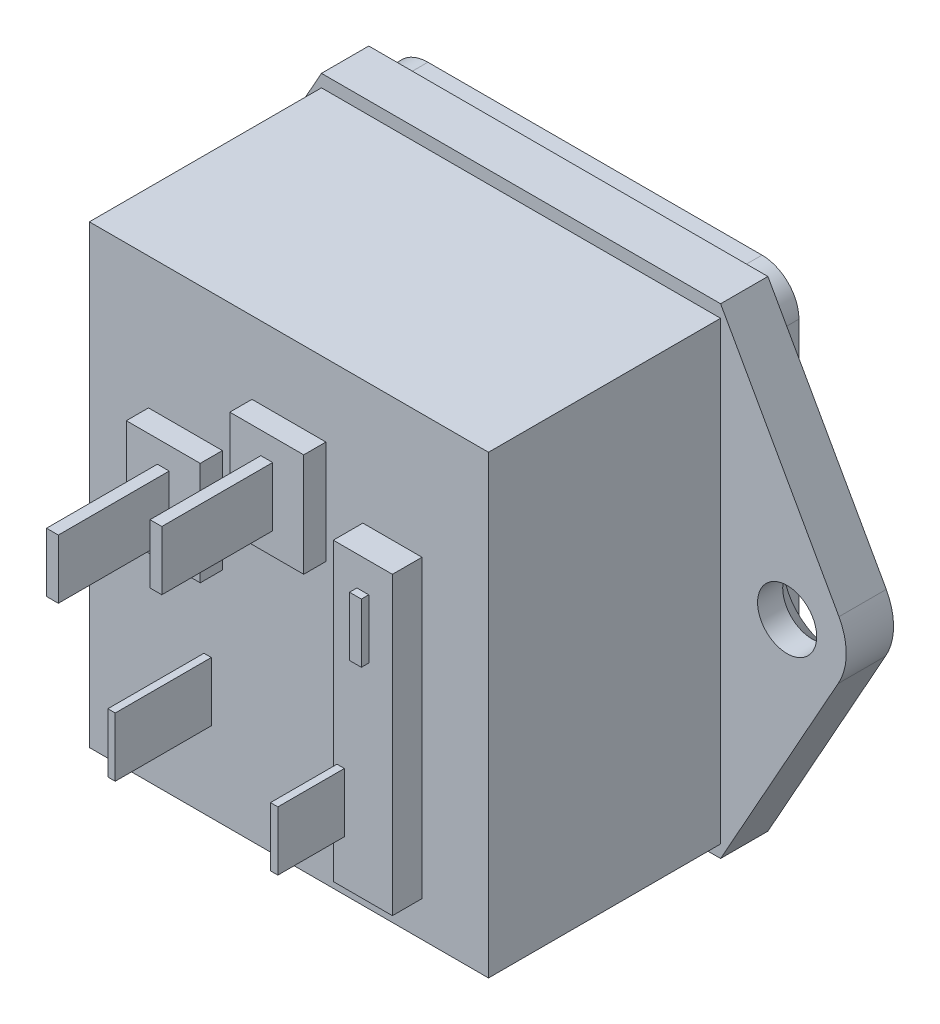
from build123d import *

# Parameters (mm, degrees)
SKETCH1_W               = 27
SKETCH1_H               = 30.8
BOSS_EXTRUDE1_DEPTH     = 15.7
BOSS_EXTRUDE2_DEPTH     = 3.2
BOSS_EXTRUDE3_DEPTH     = 1.8
SKETCH4_R               = 2
CUT_EXTRUDE1_DEPTH      = 3.2
CUT_EXTRUDE2_DEPTH      = 19
SKETCH6_W               = 2
SKETCH6_H               = 4
BOSS_EXTRUDE4_DEPTH     = 17
BOSS_EXTRUDE4_2_DEPTH   = 17
BOSS_EXTRUDE4_3_DEPTH   = 17
SKETCH7_W               = 0.8
SKETCH7_H               = 4
BOSS_EXTRUDE5_DEPTH     = 9
BOSS_EXTRUDE5_2_DEPTH   = 9
SKETCH8_W               = 4
SKETCH8_H               = 20
BOSS_EXTRUDE6_DEPTH     = 2
SKETCH9_W               = 0.8
SKETCH9_H               = 4
BOSS_EXTRUDE7_DEPTH     = 0.5
SKETCH10_W              = 0.5
SKETCH10_H              = 4
BOSS_EXTRUDE8_DEPTH     = 4.5
SKETCH11_W              = 0.5
SKETCH11_H              = 4
BOSS_EXTRUDE9_DEPTH     = 6.5
SKETCH12_W              = 5
SKETCH12_H              = 7
BOSS_EXTRUDE10_DEPTH    = 1.5
CUT_EXTRUDE_THIN1_DEPTH = 0.01
CHAMFER2_SIZE           = 1.5


with BuildPart() as part:
    # Sketch1 → Boss-Extrude1 (new body)
    with BuildSketch(Plane.XY):
        Rectangle(SKETCH1_W, SKETCH1_H)
    extrude(amount=BOSS_EXTRUDE1_DEPTH)

    # Sketch2 → Boss-Extrude2 (add)
    with BuildSketch(Plane(origin=(0, 0, 0), x_dir=(-1, 0, 0), z_dir=(0, 0, -1))):
        with BuildLine():
            Line((13.5, 16.25), (-13.5, 16.25))
            Line((-13.5, 16.25), (-21.508095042, 1.921788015))
            ThreePointArc((-21.508095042, 1.921788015), (-21.99951686, -0.062168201), (-21.446670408, -2.029892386))
            Line((-21.446670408, -2.029892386), (-13.5, -16.25))
            Line((-13.5, -16.25), (13.5, -16.25))
            Line((13.5, -16.25), (21.521453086, -1.897200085))
            ThreePointArc((21.521453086, -1.897200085), (21.999975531, 0.013991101), (21.508095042, 1.921788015))
            Line((21.508095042, 1.921788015), (13.5, 16.25))
        make_face()
    extrude(amount=BOSS_EXTRUDE2_DEPTH)

    # Sketch3 → Boss-Extrude3 (add)
    with BuildSketch(Plane(origin=(0, 0, -3.2), x_dir=(-1, 0, 0), z_dir=(0, 0, -1))):
        with BuildLine():
            Line((-13.8, -13), (-13.8, 13))
            ThreePointArc((-13.8, 13), (-13.067766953, 14.767766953), (-11.3, 15.5))
            Line((-11.3, 15.5), (11.3, 15.5))
            ThreePointArc((11.3, 15.5), (13.067766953, 14.767766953), (13.8, 13))
            Line((13.8, 13), (13.8, -13))
            ThreePointArc((13.8, -13), (13.067766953, -14.767766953), (11.3, -15.5))
            Line((11.3, -15.5), (-11.3, -15.5))
            ThreePointArc((-11.3, -15.5), (-13.067766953, -14.767766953), (-13.8, -13))
        make_face()
    extrude(amount=BOSS_EXTRUDE3_DEPTH)

    # Sketch4 → Cut-Extrude1 (cut)
    with BuildSketch(Plane(origin=(0, 0, -3.2), x_dir=(-1, 0, 0), z_dir=(0, 0, -1))):
        with Locations((-18.00098, 0)):
            Circle(SKETCH4_R)
        with Locations((18.00098, 0)):
            Circle(SKETCH4_R)
    extrude(amount=-CUT_EXTRUDE1_DEPTH, mode=Mode.SUBTRACT)

    # Sketch5 → Cut-Extrude2 (cut)
    with BuildSketch(Plane(origin=(0, 0, -5), x_dir=(-1, 0, 0), z_dir=(0, 0, -1))):
        with BuildLine():
            Line((-11, -2.1), (11, -2.1))
            ThreePointArc((11, -2.1), (11.707106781, -1.807106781), (12, -1.1))
            Line((12, -1.1), (12, 8.9))
            Line((12, 8.9), (7, 13.9))
            Line((7, 13.9), (-7, 13.9))
            Line((-7, 13.9), (-12, 8.9))
            Line((-12, 8.9), (-12, -1.1))
            ThreePointArc((-12, -1.1), (-11.707106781, -1.807106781), (-11, -2.1))
        make_face()
    extrude(amount=-CUT_EXTRUDE2_DEPTH, mode=Mode.SUBTRACT)

    # Sketch8 → Boss-Extrude6 (add)
    with BuildSketch(Plane.XY.offset(15.7)):
        with Locations((7, -3)):
            Rectangle(SKETCH8_W, SKETCH8_H)
    extrude(amount=BOSS_EXTRUDE6_DEPTH)

    # Sketch9 → Boss-Extrude7 (add)
    with BuildSketch(Plane.XY.offset(17.7)):
        with Locations((7, 3)):
            Rectangle(SKETCH9_W, SKETCH9_H)
    extrude(amount=BOSS_EXTRUDE7_DEPTH)

    # Sketch10 → Boss-Extrude8 (add)
    with BuildSketch(Plane.XY.offset(17.7)):
        with Locations((5.5, -8)):
            Rectangle(SKETCH10_W, SKETCH10_H)
    extrude(amount=BOSS_EXTRUDE8_DEPTH)



with BuildPart() as body_2:
    # Sketch6 → Boss-Extrude4 (new body)
    with BuildSketch(Plane(origin=(0, 0, 14), x_dir=(-1, 0, 0), z_dir=(0, 0, -1))):
        with Locations((0, 7)):
            Rectangle(SKETCH6_W, SKETCH6_H)
    extrude(amount=BOSS_EXTRUDE4_DEPTH)


with BuildPart() as body_3:
    # Sketch6 → Boss-Extrude4 2 (new body)
    with BuildSketch(Plane(origin=(0, 0, 14), x_dir=(-1, 0, 0), z_dir=(0, 0, -1))):
        with Locations((-7, 3)):
            Rectangle(SKETCH6_W, SKETCH6_H)
    extrude(amount=BOSS_EXTRUDE4_2_DEPTH)


with BuildPart() as body_4:
    # Sketch6 → Boss-Extrude4 3 (new body)
    with BuildSketch(Plane(origin=(0, 0, 14), x_dir=(-1, 0, 0), z_dir=(0, 0, -1))):
        with Locations((7, 3)):
            Rectangle(SKETCH6_W, SKETCH6_H)
    extrude(amount=BOSS_EXTRUDE4_3_DEPTH)


with BuildPart() as body_5:
    # Sketch7 → Boss-Extrude5 (new body)
    with BuildSketch(Plane.XY.offset(15.7)):
        with Locations((0, 7)):
            Rectangle(SKETCH7_W, SKETCH7_H)
    extrude(amount=BOSS_EXTRUDE5_DEPTH)


with BuildPart() as body_6:
    # Sketch7 → Boss-Extrude5 2 (new body)
    with BuildSketch(Plane.XY.offset(15.7)):
        with Locations((-7, 3)):
            Rectangle(SKETCH7_W, SKETCH7_H)
    extrude(amount=BOSS_EXTRUDE5_2_DEPTH)


with BuildPart() as body_7:
    # Sketch11 → Boss-Extrude9 (new body)
    with BuildSketch(Plane.XY.offset(15.7)):
        with Locations((-5.5, -8)):
            Rectangle(SKETCH11_W, SKETCH11_H)
    extrude(amount=BOSS_EXTRUDE9_DEPTH)


with BuildPart() as part_1:
    add(part.part)

    add(body_5.part)  # Boss-Extrude10 merges body 5

    add(body_6.part)  # Boss-Extrude10 merges body 6
    # Sketch12 → Boss-Extrude10 (add)
    with BuildSketch(Plane.XY.offset(15.7)):
        with Locations((0, 7)):
            Rectangle(SKETCH12_W, SKETCH12_H)
        with Locations((-7, 3)):
            Rectangle(SKETCH12_W, SKETCH12_H)
    extrude(amount=BOSS_EXTRUDE10_DEPTH)

    # Sketch14 → Cut-Extrude-Thin1 (cut)
    with BuildSketch(Plane(origin=(0, 0, -5), x_dir=(-1, 0, 0), z_dir=(0, 0, -1))):
        Polygon((4.31, -2.09), (4.31, -4.49), (12.01, -4.49), (12.01, -12.91), (-12.01, -12.91), (-12.01, -4.49), (-4.31, -4.49), (-4.31, -2.09), align=None)
        Polygon((4.29, -2.11), (4.29, -4.51), (11.99, -4.51), (11.99, -12.89), (-11.99, -12.89), (-11.99, -4.51), (-4.29, -4.51), (-4.29, -2.11), align=None, mode=Mode.SUBTRACT)
    extrude(amount=-CUT_EXTRUDE_THIN1_DEPTH, mode=Mode.SUBTRACT)

    # Chamfer2
    chamfer2_edges = [part_1.edges().sort_by_distance(p)[0] for p in [
        (20.00098, 0, -3.2),
        (-16.00098, 0, -3.2),
    ]]
    chamfer(chamfer2_edges, length=CHAMFER2_SIZE)


solid = Compound([body_2.part, body_3.part, body_4.part, body_7.part, part_1.part])
